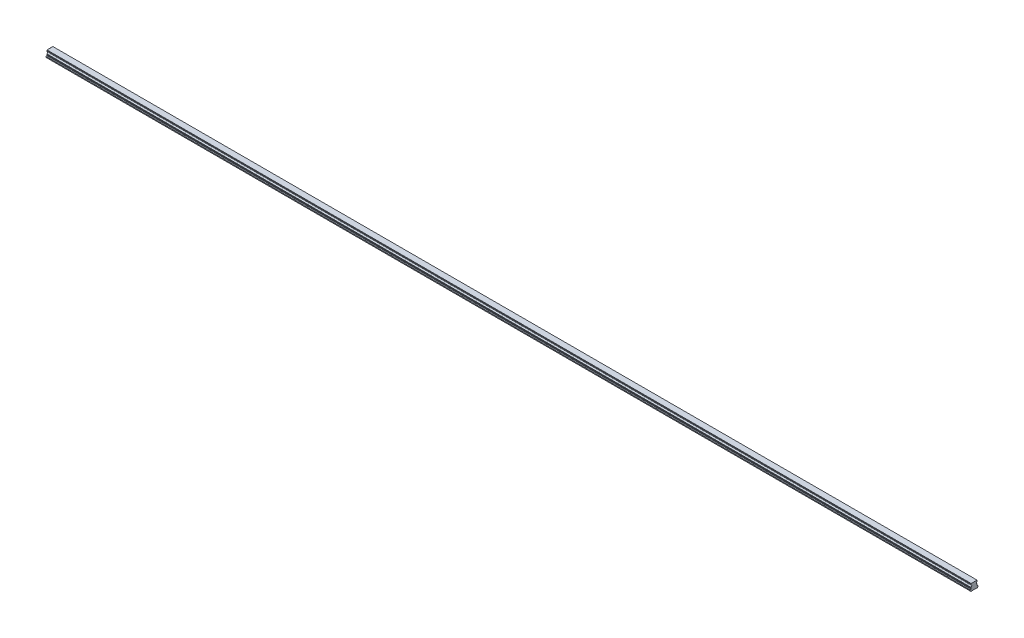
from build123d import *

# Parameters (mm, degrees)
BOSS_EXTRUDE1_DEPTH        = 2940
SKETCH3_R                  = 3
SKETCH3_R_2                = 2.5
CUT_EXTRUDE3_DEPTH         = 12
SKETCH3_2_R                = 2.5
CUT_EXTRUDE4_DEPTH         = 15
CHAMFER1_SIZE              = 0.5
LPATTERN4_COUNT            = 49
LPATTERN4_PITCH            = 60
CHAMFER1_OF_LPATTERN4_SIZE = 0.5


with BuildPart() as part:
    # Sketch1 → Boss-Extrude1 (new body)
    with BuildSketch(Plane(origin=(0, 0, 0), x_dir=(0, 0, -1), z_dir=(1, 0, 0))):
        with BuildLine():
            Line((9.375, 21.8), (-9.375, 21.8))
            Line((-9.375, 21.8), (-9.375, 20.756))
            Line((-9.375, 20.756), (-10, 19.415683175))
            Line((-10, 19.415683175), (-10, 17.685449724))
            ThreePointArc((-10, 17.685449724), (-7.2, 14.6), (-10, 11.514550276))
            Line((-10, 11.514550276), (-10, 9.784316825))
            Line((-10, 9.784316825), (-9.375, 8.444))
            Line((-9.375, 8.444), (-9.922688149, 6.4))
            Line((-9.922688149, 6.4), (-12.5, 5.489338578))
            Line((-12.5, 5.489338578), (-12.5, 2.65))
            Line((-12.5, 2.65), (-9.85, 0))
            Line((-9.85, 0), (-5.5, 0))
            Line((-5.5, 0), (-5, 0.5))
            Line((-5, 0.5), (5, 0.5))
            Line((5, 0.5), (5.5, 0))
            Line((5.5, 0), (9.85, 0))
            Line((9.85, 0), (12.5, 2.65))
            Line((12.5, 2.65), (12.5, 5.489338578))
            Line((12.5, 5.489338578), (9.922688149, 6.4))
            Line((9.922688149, 6.4), (9.375, 8.444))
            Line((9.375, 8.444), (10, 9.784316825))
            Line((10, 9.784316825), (10, 11.514550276))
            ThreePointArc((10, 11.514550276), (7.2, 14.6), (10, 17.685449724))
            Line((10, 17.685449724), (10, 19.415683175))
            Line((10, 19.415683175), (9.375, 20.756))
            Line((9.375, 20.756), (9.375, 21.8))
        make_face()
    extrude(amount=BOSS_EXTRUDE1_DEPTH)

    # Sketch3 → Cut-Extrude3 (cut)
    with BuildSketch(Plane.XZ):
        with Locations(Location((30, 0, 0), (0, 0, 270))):
            Circle(SKETCH3_R)
        with Locations(Location((30, 0, 0), (0, 0, 270))):
            Circle(SKETCH3_R_2, mode=Mode.SUBTRACT)
    cut_extrude3 = extrude(amount=-CUT_EXTRUDE3_DEPTH, mode=Mode.SUBTRACT)

    # Sketch3_2 → Cut-Extrude4 (cut)
    with BuildSketch(Plane.XZ):
        with Locations(Location((30, 0, 0), (0, 0, 270))):
            Circle(SKETCH3_2_R)
    cut_extrude4 = extrude(amount=-CUT_EXTRUDE4_DEPTH, mode=Mode.SUBTRACT)

    # Cut-Extrude5 cone 1 section (on through the dimple's axis) → Cut-Extrude5 (revolve, cut)
    with BuildSketch(Plane(origin=(30, 15, 0), x_dir=(0, 0, -1), z_dir=(1, 0, 0))):
        Polygon((0, 0), (2.5, 0), (0, 1.443375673), align=None)
    cut_extrude5 = revolve(axis=Axis((30, 15, 0), (0, 1, 0)), mode=Mode.SUBTRACT)

    # Chamfer1
    chamfer1_edges = [part.edges().sort_by_distance(p)[0] for p in [
        (30, 0.5, 3),
    ]]
    chamfer(chamfer1_edges, length=CHAMFER1_SIZE)

    # LPattern4: Cut-Extrude3, Cut-Extrude4, Cut-Extrude5 ×49
    with Locations(*[(i * LPATTERN4_PITCH, 0, 0) for i in range(1, LPATTERN4_COUNT)]):
        add(cut_extrude3, mode=Mode.SUBTRACT)
        add(cut_extrude4, mode=Mode.SUBTRACT)
        add(cut_extrude5, mode=Mode.SUBTRACT)

    # Chamfer1 of LPattern4
    chamfer1_of_lpattern4_edges = [part.edges().sort_by_distance(p)[0] for p in [
        (90, 0.5, 3),
        (150, 0.5, 3),
        (210, 0.5, 3),
        (270, 0.5, 3),
        (330, 0.5, 3),
        (390, 0.5, 3),
        (450, 0.5, 3),
        (510, 0.5, 3),
        (570, 0.5, 3),
        (630, 0.5, 3),
        (690, 0.5, 3),
        (750, 0.5, 3),
        (810, 0.5, 3),
        (870, 0.5, 3),
        (930, 0.5, 3),
        (990, 0.5, 3),
        (1050, 0.5, 3),
        (1110, 0.5, 3),
        (1170, 0.5, 3),
        (1230, 0.5, 3),
        (1290, 0.5, 3),
        (1350, 0.5, 3),
        (1410, 0.5, 3),
        (1470, 0.5, 3),
        (1530, 0.5, 3),
        (1590, 0.5, 3),
        (1650, 0.5, 3),
        (1710, 0.5, 3),
        (1770, 0.5, 3),
        (1830, 0.5, 3),
        (1890, 0.5, 3),
        (1950, 0.5, 3),
        (2010, 0.5, 3),
        (2070, 0.5, 3),
        (2130, 0.5, 3),
        (2190, 0.5, 3),
        (2250, 0.5, 3),
        (2310, 0.5, 3),
        (2370, 0.5, 3),
        (2430, 0.5, 3),
        (2490, 0.5, 3),
        (2550, 0.5, 3),
        (2610, 0.5, 3),
        (2670, 0.5, 3),
        (2730, 0.5, 3),
        (2790, 0.5, 3),
        (2850, 0.5, 3),
        (2910, 0.5, 3),
    ]]
    chamfer(chamfer1_of_lpattern4_edges, length=CHAMFER1_OF_LPATTERN4_SIZE)


solid = part.part
